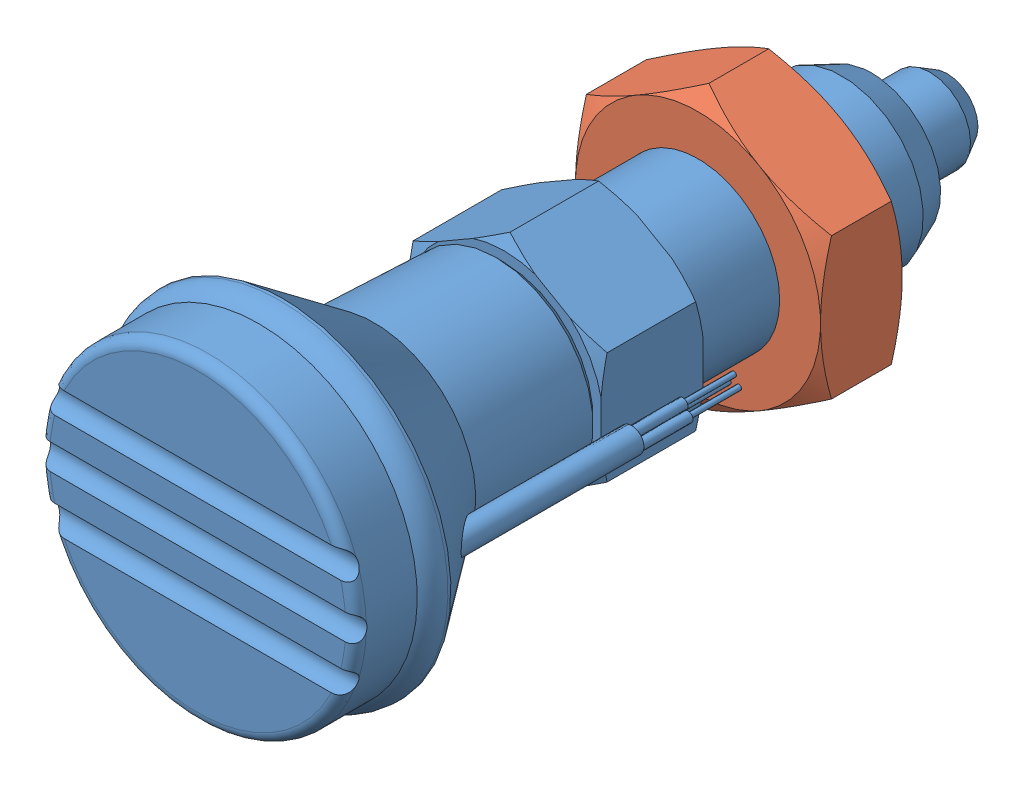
SolidWorks assembly NDX16W-S-SUS.sldasm, configuration Default (file format 15000). Lengths in mm.
Overall size (33 33 74).
2 component instances, 2 part files, 0 mates.
Components (placement in the parent):
- NDX16W-S-SUS_01-1: NDX16W-S-SUS_01.sldprt [ﾃﾞﾌｫﾙﾄ] at origin size (33 33 74)
- NDX16W-S-SUS_02-1: NDX16W-S-SUS_02.sldprt [ﾃﾞﾌｫﾙﾄ] at origin size (32.79 32.79 8.01)
